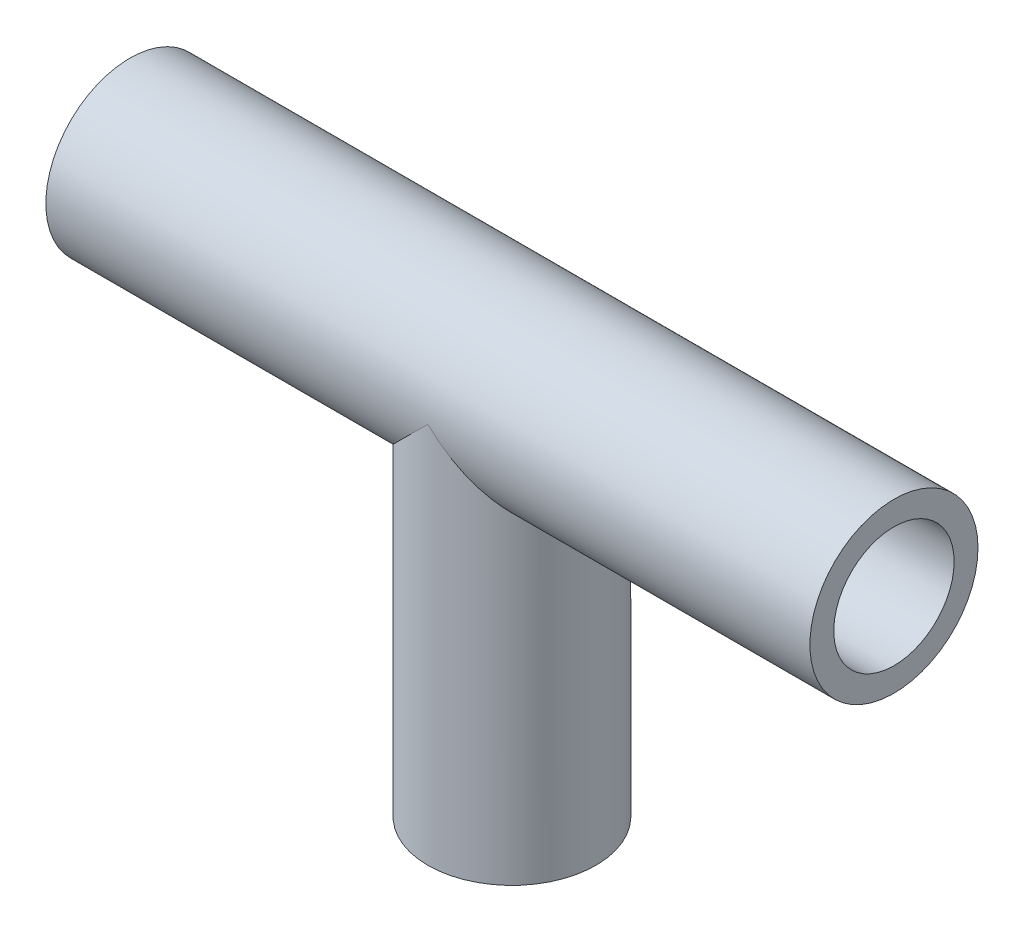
ISO-10303-21;
HEADER;
FILE_DESCRIPTION(('STEP AP214'),'2;1');
FILE_NAME('part.step','',(''),(''),'','','');
FILE_SCHEMA(('AUTOMOTIVE_DESIGN { 1 0 10303 214 1 1 1 1 }'));
ENDSEC;
DATA;
#1=APPLICATION_CONTEXT('core data for automotive mechanical design processes');
#2=APPLICATION_PROTOCOL_DEFINITION('international standard','automotive_design',2000,#1);
#3=PRODUCT_CONTEXT('',#1,'mechanical');
#4=PRODUCT('Part','Part','',(#3));
#5=PRODUCT_RELATED_PRODUCT_CATEGORY('part','',(#4));
#6=PRODUCT_DEFINITION_FORMATION('','',#4);
#7=PRODUCT_DEFINITION_CONTEXT('part definition',#1,'design');
#8=PRODUCT_DEFINITION('design','',#6,#7);
#9=PRODUCT_DEFINITION_SHAPE('','',#8);
#10=(LENGTH_UNIT() NAMED_UNIT(*) SI_UNIT(.MILLI.,.METRE.));
#11=(NAMED_UNIT(*) PLANE_ANGLE_UNIT() SI_UNIT($,.RADIAN.));
#12=(NAMED_UNIT(*) SI_UNIT($,.STERADIAN.) SOLID_ANGLE_UNIT());
#13=UNCERTAINTY_MEASURE_WITH_UNIT(LENGTH_MEASURE(1.E-05),#10,'distance_accuracy_value','');
#14=(GEOMETRIC_REPRESENTATION_CONTEXT(3) GLOBAL_UNCERTAINTY_ASSIGNED_CONTEXT((#13)) GLOBAL_UNIT_ASSIGNED_CONTEXT((#10,
#11,#12)) REPRESENTATION_CONTEXT('',''));
#15=CARTESIAN_POINT('',(0.,0.,0.));
#16=DIRECTION('',(0.,0.,1.));
#17=DIRECTION('',(1.,0.,0.));
#18=AXIS2_PLACEMENT_3D('',#15,#16,#17);
#19=CARTESIAN_POINT('',(0.,0.,0.));
#20=DIRECTION('',(1.,0.,0.));
#21=DIRECTION('',(0.,0.,-1.));
#22=AXIS2_PLACEMENT_3D('',#19,#20,#21);
#23=CYLINDRICAL_SURFACE('',#22,5.58799999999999);
#24=CARTESIAN_POINT('',(25.4,0.,0.));
#25=DIRECTION('',(1.,0.,0.));
#26=DIRECTION('',(0.,0.,-1.));
#27=AXIS2_PLACEMENT_3D('',#24,#25,#26);
#28=CIRCLE('',#27,5.58799999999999);
#29=CARTESIAN_POINT('',(25.4,0.,-5.58799999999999));
#30=VERTEX_POINT('',#29);
#31=EDGE_CURVE('E12',#30,#30,#28,.T.);
#32=ORIENTED_EDGE('',*,*,#31,.F.);
#33=EDGE_LOOP('',(#32));
#34=FACE_BOUND('',#33,.T.);
#35=CARTESIAN_POINT('',(-25.4,0.,0.));
#36=DIRECTION('',(1.,0.,0.));
#37=DIRECTION('',(0.,0.,-1.));
#38=AXIS2_PLACEMENT_3D('',#35,#36,#37);
#39=CIRCLE('',#38,5.58799999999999);
#40=CARTESIAN_POINT('',(-25.4,0.,-5.58799999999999));
#41=VERTEX_POINT('',#40);
#42=EDGE_CURVE('E62',#41,#41,#39,.T.);
#43=ORIENTED_EDGE('',*,*,#42,.T.);
#44=EDGE_LOOP('',(#43));
#45=FACE_BOUND('',#44,.T.);
#46=CARTESIAN_POINT('',(0.,0.,0.));
#47=DIRECTION('',(0.707106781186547,-0.707106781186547,0.));
#48=DIRECTION('',(-0.707106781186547,-0.707106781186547,0.));
#49=AXIS2_PLACEMENT_3D('',#46,#47,#48);
#50=ELLIPSE('',#49,7.90262538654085,5.588);
#51=CARTESIAN_POINT('',(0.,0.,-5.588));
#52=VERTEX_POINT('',#51);
#53=CARTESIAN_POINT('',(0.,0.,5.588));
#54=VERTEX_POINT('',#53);
#55=EDGE_CURVE('E54',#52,#54,#50,.F.);
#56=ORIENTED_EDGE('',*,*,#55,.T.);
#57=CARTESIAN_POINT('',(0.,0.,0.));
#58=DIRECTION('',(-0.707106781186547,-0.707106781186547,0.));
#59=DIRECTION('',(0.707106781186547,-0.707106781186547,0.));
#60=AXIS2_PLACEMENT_3D('',#57,#58,#59);
#61=ELLIPSE('',#60,7.90262538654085,5.588);
#62=EDGE_CURVE('E52',#54,#52,#61,.F.);
#63=ORIENTED_EDGE('',*,*,#62,.T.);
#64=EDGE_LOOP('',(#56,#63));
#65=FACE_BOUND('',#64,.T.);
#66=ADVANCED_FACE('F38',(#34,#45,#65),#23,.T.);
#67=CARTESIAN_POINT('',(25.4,0.,5.58799999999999));
#68=DIRECTION('',(-1.,0.,0.));
#69=DIRECTION('',(0.,0.,1.));
#70=AXIS2_PLACEMENT_3D('',#67,#68,#69);
#71=PLANE('',#70);
#72=CARTESIAN_POINT('',(25.4,0.,0.));
#73=DIRECTION('',(1.,0.,0.));
#74=DIRECTION('',(0.,0.,-1.));
#75=AXIS2_PLACEMENT_3D('',#72,#73,#74);
#76=CIRCLE('',#75,4.00049999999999);
#77=CARTESIAN_POINT('',(25.4,0.,-4.00049999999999));
#78=VERTEX_POINT('',#77);
#79=EDGE_CURVE('E46',#78,#78,#76,.T.);
#80=ORIENTED_EDGE('',*,*,#79,.F.);
#81=EDGE_LOOP('',(#80));
#82=FACE_BOUND('',#81,.T.);
#83=ORIENTED_EDGE('',*,*,#31,.T.);
#84=EDGE_LOOP('',(#83));
#85=FACE_BOUND('',#84,.T.);
#86=ADVANCED_FACE('F73',(#82,#85),#71,.F.);
#87=CARTESIAN_POINT('',(0.,0.,0.));
#88=DIRECTION('',(1.,0.,0.));
#89=DIRECTION('',(0.,0.,-1.));
#90=AXIS2_PLACEMENT_3D('',#87,#88,#89);
#91=CYLINDRICAL_SURFACE('',#90,4.00049999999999);
#92=CARTESIAN_POINT('',(-25.4,0.,0.));
#93=DIRECTION('',(1.,0.,0.));
#94=DIRECTION('',(0.,0.,-1.));
#95=AXIS2_PLACEMENT_3D('',#92,#93,#94);
#96=CIRCLE('',#95,4.0005);
#97=CARTESIAN_POINT('',(-25.4,0.,-4.0005));
#98=VERTEX_POINT('',#97);
#99=EDGE_CURVE('E65',#98,#98,#96,.T.);
#100=ORIENTED_EDGE('',*,*,#99,.F.);
#101=EDGE_LOOP('',(#100));
#102=FACE_BOUND('',#101,.T.);
#103=ORIENTED_EDGE('',*,*,#79,.T.);
#104=EDGE_LOOP('',(#103));
#105=FACE_BOUND('',#104,.T.);
#106=ADVANCED_FACE('F71',(#102,#105),#91,.F.);
#107=CARTESIAN_POINT('',(-25.4,0.,5.58799999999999));
#108=DIRECTION('',(1.,0.,0.));
#109=DIRECTION('',(0.,0.,-1.));
#110=AXIS2_PLACEMENT_3D('',#107,#108,#109);
#111=PLANE('',#110);
#112=ORIENTED_EDGE('',*,*,#42,.F.);
#113=EDGE_LOOP('',(#112));
#114=FACE_BOUND('',#113,.T.);
#115=ORIENTED_EDGE('',*,*,#99,.T.);
#116=EDGE_LOOP('',(#115));
#117=FACE_BOUND('',#116,.T.);
#118=ADVANCED_FACE('F82',(#114,#117),#111,.F.);
#119=CARTESIAN_POINT('',(0.,-25.4,0.));
#120=DIRECTION('',(0.,1.,0.));
#121=DIRECTION('',(0.,0.,1.));
#122=AXIS2_PLACEMENT_3D('',#119,#120,#121);
#123=PLANE('',#122);
#124=CARTESIAN_POINT('',(0.,-25.4,0.));
#125=DIRECTION('',(0.,1.,0.));
#126=DIRECTION('',(0.,0.,1.));
#127=AXIS2_PLACEMENT_3D('',#124,#125,#126);
#128=CIRCLE('',#127,4.0005);
#129=CARTESIAN_POINT('',(0.,-25.4,4.0005));
#130=VERTEX_POINT('',#129);
#131=EDGE_CURVE('E106',#130,#130,#128,.T.);
#132=ORIENTED_EDGE('',*,*,#131,.T.);
#133=EDGE_LOOP('',(#132));
#134=FACE_BOUND('',#133,.T.);
#135=CARTESIAN_POINT('',(0.,-25.4,0.));
#136=DIRECTION('',(0.,1.,0.));
#137=DIRECTION('',(0.,0.,1.));
#138=AXIS2_PLACEMENT_3D('',#135,#136,#137);
#139=CIRCLE('',#138,5.588);
#140=CARTESIAN_POINT('',(0.,-25.4,5.588));
#141=VERTEX_POINT('',#140);
#142=EDGE_CURVE('E66',#141,#141,#139,.T.);
#143=ORIENTED_EDGE('',*,*,#142,.F.);
#144=EDGE_LOOP('',(#143));
#145=FACE_BOUND('',#144,.T.);
#146=ADVANCED_FACE('F85',(#134,#145),#123,.F.);
#147=CARTESIAN_POINT('',(0.,500000.,0.));
#148=DIRECTION('',(0.,-1.,0.));
#149=DIRECTION('',(0.,0.,-1.));
#150=AXIS2_PLACEMENT_3D('',#147,#148,#149);
#151=CYLINDRICAL_SURFACE('',#150,5.588);
#152=ORIENTED_EDGE('',*,*,#142,.T.);
#153=EDGE_LOOP('',(#152));
#154=FACE_BOUND('',#153,.T.);
#155=ORIENTED_EDGE('',*,*,#55,.F.);
#156=ORIENTED_EDGE('',*,*,#62,.F.);
#157=EDGE_LOOP('',(#155,#156));
#158=FACE_BOUND('',#157,.T.);
#159=ADVANCED_FACE('F58',(#154,#158),#151,.T.);
#160=CARTESIAN_POINT('',(0.,500000.,0.));
#161=DIRECTION('',(0.,-1.,0.));
#162=DIRECTION('',(0.,0.,-1.));
#163=AXIS2_PLACEMENT_3D('',#160,#161,#162);
#164=CYLINDRICAL_SURFACE('',#163,4.0005);
#165=ORIENTED_EDGE('',*,*,#131,.F.);
#166=EDGE_LOOP('',(#165));
#167=FACE_BOUND('',#166,.T.);
#168=CARTESIAN_POINT('',(0.,-3.90150531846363,-4.0005));
#169=CARTESIAN_POINT('',(-0.0951337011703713,-3.90150753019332,-4.00049885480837));
#170=CARTESIAN_POINT('',(-0.190286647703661,-3.90500339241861,-3.99709766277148));
#171=CARTESIAN_POINT('',(-0.379659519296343,-3.91879451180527,-3.98357664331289));
#172=CARTESIAN_POINT('',(-0.473878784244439,-3.92909427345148,-3.97345236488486));
#173=CARTESIAN_POINT('',(-0.660712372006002,-3.9559721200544,-3.94669308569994));
#174=CARTESIAN_POINT('',(-0.753322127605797,-3.9725657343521,-3.93004197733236));
#175=CARTESIAN_POINT('',(-0.936069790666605,-4.01123161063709,-3.89056899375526));
#176=CARTESIAN_POINT('',(-1.02620621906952,-4.03330707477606,-3.86774351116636));
#177=CARTESIAN_POINT('',(-1.28986805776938,-4.10575320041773,-3.79122848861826));
#178=CARTESIAN_POINT('',(-1.45919279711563,-4.16275506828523,-3.72911826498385));
#179=CARTESIAN_POINT('',(-1.78443780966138,-4.28757714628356,-3.58489988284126));
#180=CARTESIAN_POINT('',(-1.94035973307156,-4.35539602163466,-3.50279419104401));
#181=CARTESIAN_POINT('',(-2.26615246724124,-4.50920347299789,-3.3032550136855));
#182=CARTESIAN_POINT('',(-2.43325150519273,-4.59622982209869,-3.1820941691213));
#183=CARTESIAN_POINT('',(-2.74731009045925,-4.76994300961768,-2.91526448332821));
#184=CARTESIAN_POINT('',(-2.89424257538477,-4.85662924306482,-2.76956328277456));
#185=CARTESIAN_POINT('',(-3.10974441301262,-4.98881866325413,-2.51961578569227));
#186=CARTESIAN_POINT('',(-3.1857295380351,-5.03662517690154,-2.42289082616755));
#187=CARTESIAN_POINT('',(-3.32916253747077,-5.12855036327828,-2.2216955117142));
#188=CARTESIAN_POINT('',(-3.3966142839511,-5.17267070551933,-2.11722870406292));
#189=CARTESIAN_POINT('',(-3.52212334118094,-5.255939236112,-1.9011130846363));
#190=CARTESIAN_POINT('',(-3.58019354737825,-5.29509423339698,-1.78947443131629));
#191=CARTESIAN_POINT('',(-3.68612711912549,-5.36728781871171,-1.55964261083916));
#192=CARTESIAN_POINT('',(-3.73399521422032,-5.40032923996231,-1.44145251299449));
#193=CARTESIAN_POINT('',(-3.83727173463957,-5.4721527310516,-1.14602786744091));
#194=CARTESIAN_POINT('',(-3.8867355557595,-5.50706718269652,-0.965688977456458));
#195=CARTESIAN_POINT('',(-3.96007428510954,-5.55907034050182,-0.597505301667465));
#196=CARTESIAN_POINT('',(-3.98397027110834,-5.5761737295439,-0.409666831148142));
#197=CARTESIAN_POINT('',(-4.00486915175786,-5.59112362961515,-0.0312931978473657));
#198=CARTESIAN_POINT('',(-4.0018144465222,-5.58892889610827,0.15924687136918));
#199=CARTESIAN_POINT('',(-3.96885273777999,-5.56537567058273,0.53678879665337));
#200=CARTESIAN_POINT('',(-3.93893853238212,-5.54401203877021,0.72378969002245));
#201=CARTESIAN_POINT('',(-3.85511692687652,-5.48478093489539,1.08417129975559));
#202=CARTESIAN_POINT('',(-3.80186239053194,-5.44736308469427,1.25778105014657));
#203=CARTESIAN_POINT('',(-3.67397560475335,-5.35889106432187,1.59315691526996));
#204=CARTESIAN_POINT('',(-3.59933913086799,-5.30783419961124,1.75492068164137));
#205=CARTESIAN_POINT('',(-3.42187582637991,-5.18904068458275,2.08160505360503));
#206=CARTESIAN_POINT('',(-3.31683481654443,-5.12007951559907,2.24486982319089));
#207=CARTESIAN_POINT('',(-3.08647408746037,-4.97394544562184,2.5523831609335));
#208=CARTESIAN_POINT('',(-2.96113366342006,-4.89676418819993,2.69661203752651));
#209=CARTESIAN_POINT('',(-2.66748467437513,-4.72445622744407,2.9898550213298));
#210=CARTESIAN_POINT('',(-2.4955170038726,-4.62865184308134,3.13481496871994));
#211=CARTESIAN_POINT('',(-2.12811385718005,-4.44135021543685,3.39496593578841));
#212=CARTESIAN_POINT('',(-1.93267896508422,-4.3498528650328,3.51015769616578));
#213=CARTESIAN_POINT('',(-1.56591116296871,-4.20147871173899,3.68557163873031));
#214=CARTESIAN_POINT('',(-1.39900115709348,-4.1414394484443,3.75232796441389));
#215=CARTESIAN_POINT('',(-1.05318621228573,-4.0378146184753,3.86362757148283));
#216=CARTESIAN_POINT('',(-0.874308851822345,-3.99419265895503,3.90822005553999));
#217=CARTESIAN_POINT('',(-0.535040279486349,-3.93502631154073,3.96772409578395));
#218=CARTESIAN_POINT('',(-0.375822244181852,-3.91628590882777,3.98604736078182));
#219=CARTESIAN_POINT('',(-0.0552720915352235,-3.89862402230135,4.00333050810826));
#220=CARTESIAN_POINT('',(0.106058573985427,-3.89968957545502,4.00230305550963));
#221=CARTESIAN_POINT('',(0.42570861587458,-3.92141977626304,3.98100607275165));
#222=CARTESIAN_POINT('',(0.584033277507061,-3.94204598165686,3.96077428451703));
#223=CARTESIAN_POINT('',(0.894314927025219,-3.99977295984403,3.90246218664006));
#224=CARTESIAN_POINT('',(1.04626215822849,-4.03689803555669,3.86435554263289));
#225=CARTESIAN_POINT('',(1.4026221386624,-4.14115432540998,3.75293263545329));
#226=CARTESIAN_POINT('',(1.60272501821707,-4.21434511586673,3.67157154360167));
#227=CARTESIAN_POINT('',(1.98356333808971,-4.37334599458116,3.48066848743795));
#228=CARTESIAN_POINT('',(2.16425967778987,-4.45918076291,3.37107108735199));
#229=CARTESIAN_POINT('',(2.5098021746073,-4.63663242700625,3.12270865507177));
#230=CARTESIAN_POINT('',(2.67409657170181,-4.72834250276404,2.98324321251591));
#231=CARTESIAN_POINT('',(2.97924961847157,-4.90738777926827,2.67853017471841));
#232=CARTESIAN_POINT('',(3.12013047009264,-4.99472706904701,2.51330729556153));
#233=CARTESIAN_POINT('',(3.3659349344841,-5.15199461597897,2.17148075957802));
#234=CARTESIAN_POINT('',(3.47275383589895,-5.22273476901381,1.99663815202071));
#235=CARTESIAN_POINT('',(3.61311418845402,-5.31743949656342,1.72049417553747));
#236=CARTESIAN_POINT('',(3.65660296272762,-5.34711634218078,1.62609257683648));
#237=CARTESIAN_POINT('',(3.73645738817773,-5.40203787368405,1.43310007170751));
#238=CARTESIAN_POINT('',(3.77282636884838,-5.42728463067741,1.33451114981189));
#239=CARTESIAN_POINT('',(3.83821754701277,-5.4729430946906,1.13287862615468));
#240=CARTESIAN_POINT('',(3.86717596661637,-5.49331273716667,1.02980473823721));
#241=CARTESIAN_POINT('',(3.91686385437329,-5.528404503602,0.820796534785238));
#242=CARTESIAN_POINT('',(3.93759750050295,-5.54312949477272,0.714863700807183));
#243=CARTESIAN_POINT('',(3.97046991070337,-5.56652869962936,0.501060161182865));
#244=CARTESIAN_POINT('',(3.98261276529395,-5.57520579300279,0.393190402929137));
#245=CARTESIAN_POINT('',(3.99807942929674,-5.58626467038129,0.176505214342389));
#246=CARTESIAN_POINT('',(4.00140443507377,-5.5886473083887,0.0676899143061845));
#247=CARTESIAN_POINT('',(3.99932164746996,-5.58715657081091,-0.13542359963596));
#248=CARTESIAN_POINT('',(3.99500903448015,-5.58406775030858,-0.22974137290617));
#249=CARTESIAN_POINT('',(3.97976097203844,-5.57316898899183,-0.417594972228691));
#250=CARTESIAN_POINT('',(3.96882347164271,-5.5653575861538,-0.511130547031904));
#251=CARTESIAN_POINT('',(3.94048614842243,-5.5451848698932,-0.696686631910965));
#252=CARTESIAN_POINT('',(3.92308851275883,-5.53282509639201,-0.788707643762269));
#253=CARTESIAN_POINT('',(3.88207427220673,-5.50382027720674,-0.970677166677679));
#254=CARTESIAN_POINT('',(3.8584552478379,-5.48717356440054,-1.06062485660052));
#255=CARTESIAN_POINT('',(3.77910520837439,-5.43156861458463,-1.32514393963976));
#256=CARTESIAN_POINT('',(3.71463381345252,-5.38676579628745,-1.49596627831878));
#257=CARTESIAN_POINT('',(3.56501296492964,-5.28470234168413,-1.82408550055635));
#258=CARTESIAN_POINT('',(3.47986007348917,-5.22743963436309,-1.98138012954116));
#259=CARTESIAN_POINT('',(3.27836902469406,-5.09537650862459,-2.30148549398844));
#260=CARTESIAN_POINT('',(3.15934692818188,-5.01924594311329,-2.46205190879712));
#261=CARTESIAN_POINT('',(2.9005721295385,-4.86051082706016,-2.76225495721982));
#262=CARTESIAN_POINT('',(2.76078810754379,-4.77789658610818,-2.90185931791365));
#263=CARTESIAN_POINT('',(2.52354776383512,-4.64593365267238,-3.10632405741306));
#264=CARTESIAN_POINT('',(2.43211558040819,-4.59677673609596,-3.17842731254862));
#265=CARTESIAN_POINT('',(2.24289207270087,-4.49952314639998,-3.31466936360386));
#266=CARTESIAN_POINT('',(2.14509906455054,-4.45142675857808,-3.37880603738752));
#267=CARTESIAN_POINT('',(1.94344323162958,-4.35783842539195,-3.49868063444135));
#268=CARTESIAN_POINT('',(1.83958662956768,-4.31234390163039,-3.55442696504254));
#269=CARTESIAN_POINT('',(1.62592057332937,-4.22561341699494,-3.65710968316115));
#270=CARTESIAN_POINT('',(1.5161109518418,-4.18437757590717,-3.70404582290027));
#271=CARTESIAN_POINT('',(1.24640689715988,-4.09310994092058,-3.80506089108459));
#272=CARTESIAN_POINT('',(1.08376483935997,-4.04597433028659,-3.8547176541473));
#273=CARTESIAN_POINT('',(0.833454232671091,-3.98870763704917,-3.9136556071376));
#274=CARTESIAN_POINT('',(0.749062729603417,-3.97187016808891,-3.93069941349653));
#275=CARTESIAN_POINT('',(0.578530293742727,-3.94327216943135,-3.95938916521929));
#276=CARTESIAN_POINT('',(0.492390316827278,-3.93150894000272,-3.97103798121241));
#277=CARTESIAN_POINT('',(0.338542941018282,-3.91559562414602,-3.98672145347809));
#278=CARTESIAN_POINT('',(0.271062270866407,-3.91032659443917,-3.99188110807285));
#279=CARTESIAN_POINT('',(0.135724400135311,-3.90328015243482,-3.99877128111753));
#280=CARTESIAN_POINT('',(0.0678670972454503,-3.90150374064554,-4.00050081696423));
#281=CARTESIAN_POINT('',(0.,-3.90150531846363,-4.0005));
#282=B_SPLINE_CURVE_WITH_KNOTS('',3,(#168,#169,#170,#171,#172,#173,#174,#175,#176,#177,#178,
#179,#180,#181,#182,#183,#184,#185,#186,#187,#188,#189,#190,#191,#192,#193,#194,#195,#196,#197,
#198,#199,#200,#201,#202,#203,#204,#205,#206,#207,#208,#209,#210,#211,#212,#213,#214,#215,#216,
#217,#218,#219,#220,#221,#222,#223,#224,#225,#226,#227,#228,#229,#230,#231,#232,#233,#234,#235,
#236,#237,#238,#239,#240,#241,#242,#243,#244,#245,#246,#247,#248,#249,#250,#251,#252,#253,#254,
#255,#256,#257,#258,#259,#260,#261,#262,#263,#264,#265,#266,#267,#268,#269,#270,#271,#272,#273,
#274,#275,#276,#277,#278,#279,#280,#281),.UNSPECIFIED.,.T.,.F.,(4,2,2,2,2,2,2,2,2,2,2,2,2,2,2,2,
2,2,2,2,2,2,2,2,2,2,2,2,2,2,2,2,2,2,2,2,2,2,2,2,2,2,2,2,2,2,2,2,2,2,2,2,2,2,2,2,4),(0.,
0.28531211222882,0.570813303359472,0.857023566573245,1.14340141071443,1.70843541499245,
2.27339974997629,2.9430874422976,3.61366521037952,4.00908726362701,4.40432924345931,
4.79902323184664,5.19353384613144,5.76157306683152,6.32914364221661,6.89792754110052,
7.46686399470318,8.02081179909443,8.57486912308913,9.19064887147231,9.80706069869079,
10.5375492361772,11.2680195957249,11.8346850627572,12.4000868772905,12.8819571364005,
13.3635120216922,13.8441224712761,14.3254432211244,15.0059483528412,15.6877998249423,
16.3878498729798,17.0872322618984,17.7345854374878,18.0585194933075,18.3823017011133,
18.7087832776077,19.0350987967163,19.3612588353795,19.6873746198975,19.9704271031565,
20.2535672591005,20.5366116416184,20.8197662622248,21.3813192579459,21.9429656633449,
22.5822676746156,23.2225440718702,23.601366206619,23.9802890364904,24.3588296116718,
24.7373808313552,25.2644484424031,25.5273626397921,25.7901367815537,25.9936163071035,
26.1971541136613),.UNSPECIFIED.);
#283=CARTESIAN_POINT('',(0.,-3.90150531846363,-4.0005));
#284=VERTEX_POINT('',#283);
#285=EDGE_CURVE('E56',#284,#284,#282,.T.);
#286=ORIENTED_EDGE('',*,*,#285,.T.);
#287=EDGE_LOOP('',(#286));
#288=FACE_BOUND('',#287,.T.);
#289=ADVANCED_FACE('F87',(#167,#288),#164,.F.);
#290=ORIENTED_EDGE('',*,*,#285,.F.);
#291=EDGE_LOOP('',(#290));
#292=FACE_BOUND('',#291,.T.);
#293=ADVANCED_FACE('F40',(#292),#23,.T.);
#294=CLOSED_SHELL('',(#66,#86,#106,#118,#146,#159,#289,#293));
#295=MANIFOLD_SOLID_BREP('B2',#294);
#296=ADVANCED_BREP_SHAPE_REPRESENTATION('',(#18,#295),#14);
#297=SHAPE_DEFINITION_REPRESENTATION(#9,#296);
ENDSEC;
END-ISO-10303-21;
